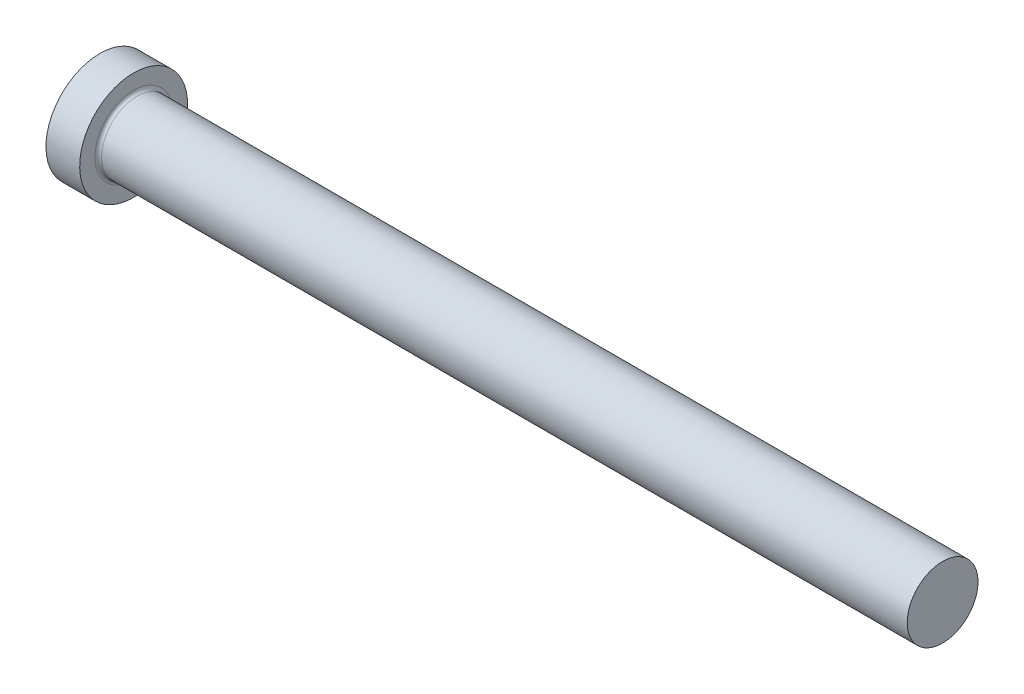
ISO-10303-21;
HEADER;
FILE_DESCRIPTION(('STEP AP214'),'2;1');
FILE_NAME('part.step','',(''),(''),'','','');
FILE_SCHEMA(('AUTOMOTIVE_DESIGN { 1 0 10303 214 1 1 1 1 }'));
ENDSEC;
DATA;
#1=APPLICATION_CONTEXT('core data for automotive mechanical design processes');
#2=APPLICATION_PROTOCOL_DEFINITION('international standard','automotive_design',2000,#1);
#3=PRODUCT_CONTEXT('',#1,'mechanical');
#4=PRODUCT('Part','Part','',(#3));
#5=PRODUCT_RELATED_PRODUCT_CATEGORY('part','',(#4));
#6=PRODUCT_DEFINITION_FORMATION('','',#4);
#7=PRODUCT_DEFINITION_CONTEXT('part definition',#1,'design');
#8=PRODUCT_DEFINITION('design','',#6,#7);
#9=PRODUCT_DEFINITION_SHAPE('','',#8);
#10=(LENGTH_UNIT() NAMED_UNIT(*) SI_UNIT(.MILLI.,.METRE.));
#11=(NAMED_UNIT(*) PLANE_ANGLE_UNIT() SI_UNIT($,.RADIAN.));
#12=(NAMED_UNIT(*) SI_UNIT($,.STERADIAN.) SOLID_ANGLE_UNIT());
#13=UNCERTAINTY_MEASURE_WITH_UNIT(LENGTH_MEASURE(1.E-05),#10,'distance_accuracy_value','');
#14=(GEOMETRIC_REPRESENTATION_CONTEXT(3) GLOBAL_UNCERTAINTY_ASSIGNED_CONTEXT((#13)) GLOBAL_UNIT_ASSIGNED_CONTEXT((#10,
#11,#12)) REPRESENTATION_CONTEXT('',''));
#15=CARTESIAN_POINT('',(0.,0.,0.));
#16=DIRECTION('',(0.,0.,1.));
#17=DIRECTION('',(1.,0.,0.));
#18=AXIS2_PLACEMENT_3D('',#15,#16,#17);
#19=CARTESIAN_POINT('',(0.,0.,0.));
#20=DIRECTION('',(-1.,0.,0.));
#21=DIRECTION('',(0.,-1.,0.));
#22=AXIS2_PLACEMENT_3D('',#19,#20,#21);
#23=PLANE('',#22);
#24=CARTESIAN_POINT('',(0.,0.,0.));
#25=DIRECTION('',(1.,0.,0.));
#26=DIRECTION('',(0.,1.,0.));
#27=AXIS2_PLACEMENT_3D('',#24,#25,#26);
#28=CIRCLE('',#27,8.);
#29=CARTESIAN_POINT('',(0.,8.,0.));
#30=VERTEX_POINT('',#29);
#31=EDGE_CURVE('E25',#30,#30,#28,.T.);
#32=ORIENTED_EDGE('',*,*,#31,.F.);
#33=EDGE_LOOP('',(#32));
#34=FACE_BOUND('',#33,.T.);
#35=ADVANCED_FACE('F14',(#34),#23,.T.);
#36=CARTESIAN_POINT('',(125.,0.,0.));
#37=DIRECTION('',(1.,0.,0.));
#38=DIRECTION('',(0.,1.,0.));
#39=AXIS2_PLACEMENT_3D('',#36,#37,#38);
#40=CYLINDRICAL_SURFACE('',#39,8.);
#41=ORIENTED_EDGE('',*,*,#31,.T.);
#42=EDGE_LOOP('',(#41));
#43=FACE_BOUND('',#42,.T.);
#44=CARTESIAN_POINT('',(5.,0.,0.));
#45=DIRECTION('',(1.,0.,0.));
#46=DIRECTION('',(0.,1.,0.));
#47=AXIS2_PLACEMENT_3D('',#44,#45,#46);
#48=CIRCLE('',#47,8.);
#49=CARTESIAN_POINT('',(5.,8.,0.));
#50=VERTEX_POINT('',#49);
#51=EDGE_CURVE('E29',#50,#50,#48,.T.);
#52=ORIENTED_EDGE('',*,*,#51,.F.);
#53=EDGE_LOOP('',(#52));
#54=FACE_BOUND('',#53,.T.);
#55=ADVANCED_FACE('F51',(#43,#54),#40,.T.);
#56=CARTESIAN_POINT('',(5.,8.,0.));
#57=DIRECTION('',(1.,0.,0.));
#58=DIRECTION('',(0.,1.,0.));
#59=AXIS2_PLACEMENT_3D('',#56,#57,#58);
#60=PLANE('',#59);
#61=CARTESIAN_POINT('',(5.,0.,0.));
#62=DIRECTION('',(1.,0.,0.));
#63=DIRECTION('',(0.,1.,0.));
#64=AXIS2_PLACEMENT_3D('',#61,#62,#63);
#65=CIRCLE('',#64,5.75);
#66=CARTESIAN_POINT('',(5.,5.75,0.));
#67=VERTEX_POINT('',#66);
#68=EDGE_CURVE('E9',#67,#67,#65,.F.);
#69=ORIENTED_EDGE('',*,*,#68,.T.);
#70=EDGE_LOOP('',(#69));
#71=FACE_BOUND('',#70,.T.);
#72=ORIENTED_EDGE('',*,*,#51,.T.);
#73=EDGE_LOOP('',(#72));
#74=FACE_BOUND('',#73,.T.);
#75=ADVANCED_FACE('F42',(#71,#74),#60,.T.);
#76=CARTESIAN_POINT('',(125.,0.,0.));
#77=DIRECTION('',(1.,0.,0.));
#78=DIRECTION('',(0.,1.,0.));
#79=AXIS2_PLACEMENT_3D('',#76,#77,#78);
#80=CYLINDRICAL_SURFACE('',#79,5.25);
#81=CARTESIAN_POINT('',(5.5,0.,0.));
#82=DIRECTION('',(1.,0.,0.));
#83=DIRECTION('',(0.,1.,0.));
#84=AXIS2_PLACEMENT_3D('',#81,#82,#83);
#85=CIRCLE('',#84,5.25);
#86=CARTESIAN_POINT('',(5.5,5.25,0.));
#87=VERTEX_POINT('',#86);
#88=EDGE_CURVE('E21',#87,#87,#85,.T.);
#89=ORIENTED_EDGE('',*,*,#88,.T.);
#90=EDGE_LOOP('',(#89));
#91=FACE_BOUND('',#90,.T.);
#92=CARTESIAN_POINT('',(125.,0.,0.));
#93=DIRECTION('',(1.,0.,0.));
#94=DIRECTION('',(0.,1.,0.));
#95=AXIS2_PLACEMENT_3D('',#92,#93,#94);
#96=CIRCLE('',#95,5.25);
#97=CARTESIAN_POINT('',(125.,5.25,0.));
#98=VERTEX_POINT('',#97);
#99=EDGE_CURVE('E34',#98,#98,#96,.T.);
#100=ORIENTED_EDGE('',*,*,#99,.F.);
#101=EDGE_LOOP('',(#100));
#102=FACE_BOUND('',#101,.T.);
#103=ADVANCED_FACE('F40',(#91,#102),#80,.T.);
#104=CARTESIAN_POINT('',(125.,5.25,0.));
#105=DIRECTION('',(1.,0.,0.));
#106=DIRECTION('',(0.,1.,0.));
#107=AXIS2_PLACEMENT_3D('',#104,#105,#106);
#108=PLANE('',#107);
#109=ORIENTED_EDGE('',*,*,#99,.T.);
#110=EDGE_LOOP('',(#109));
#111=FACE_BOUND('',#110,.T.);
#112=ADVANCED_FACE('F38',(#111),#108,.T.);
#113=CARTESIAN_POINT('',(5.5,0.,0.));
#114=DIRECTION('',(1.,0.,0.));
#115=DIRECTION('',(0.,1.,0.));
#116=AXIS2_PLACEMENT_3D('',#113,#114,#115);
#117=TOROIDAL_SURFACE('',#116,5.75,0.5);
#118=ORIENTED_EDGE('',*,*,#68,.F.);
#119=EDGE_LOOP('',(#118));
#120=FACE_BOUND('',#119,.T.);
#121=ORIENTED_EDGE('',*,*,#88,.F.);
#122=EDGE_LOOP('',(#121));
#123=FACE_BOUND('',#122,.T.);
#124=ADVANCED_FACE('F16',(#120,#123),#117,.F.);
#125=CLOSED_SHELL('',(#35,#55,#75,#103,#112,#124));
#126=MANIFOLD_SOLID_BREP('B1',#125);
#127=ADVANCED_BREP_SHAPE_REPRESENTATION('',(#18,#126),#14);
#128=SHAPE_DEFINITION_REPRESENTATION(#9,#127);
ENDSEC;
END-ISO-10303-21;
